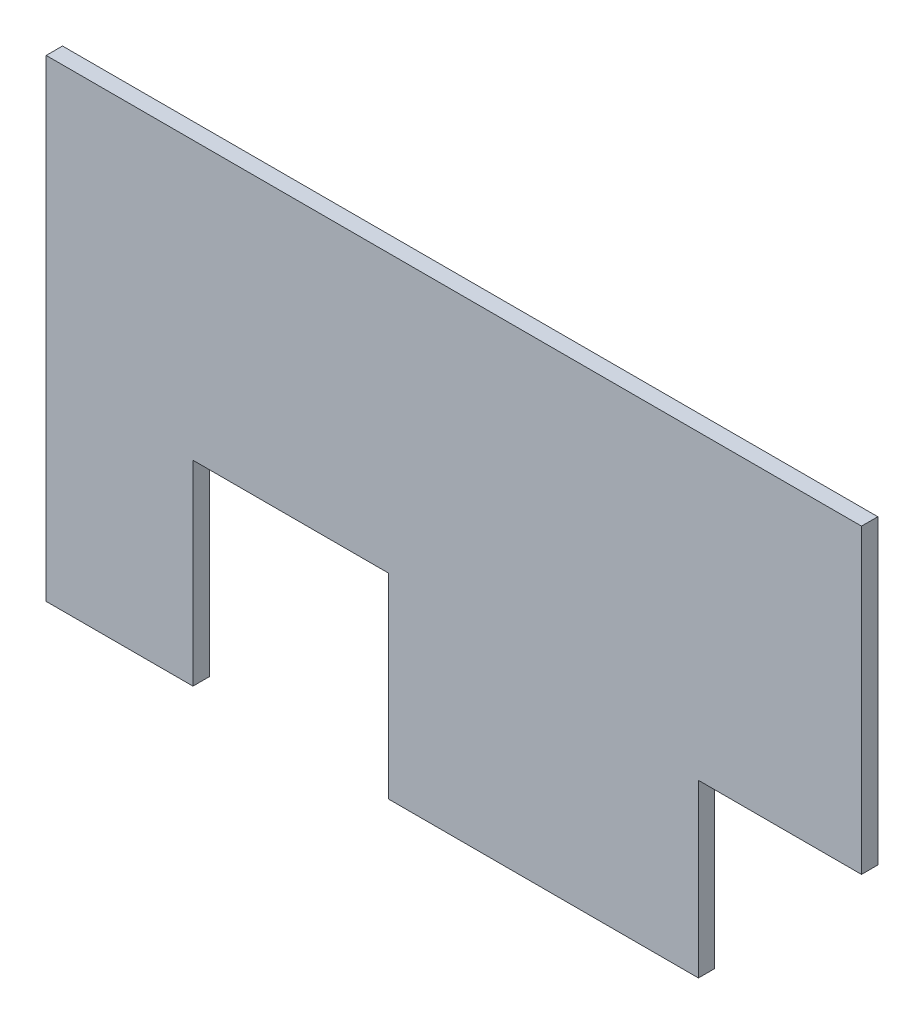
from build123d import *

# Parameters (mm, degrees)
ESQUISSE1_W             = 50
ESQUISSE1_H             = 29
BOSS_EXTRU_1_DEPTH      = 1
ESQUISSE2_W             = 12
ESQUISSE2_H             = 12
ENL_V_MAT_EXTRU_1_DEPTH = 1.5
ESQUISSE3_W             = 10
ESQUISSE3_H             = 10.5
ENL_V_MAT_EXTRU_2_DEPTH = 1.5


with BuildPart() as part:
    # Esquisse1 → Boss.-Extru.1 (new body)
    with BuildSketch(Plane.XY):
        with Locations((25, 14.5)):
            Rectangle(ESQUISSE1_W, ESQUISSE1_H)
    extrude(amount=BOSS_EXTRU_1_DEPTH)

    # Esquisse2 → Enl_v. mat.-Extru.1 (cut)
    with BuildSketch(Plane.XY.offset(1)):
        with Locations((15, 6)):
            Rectangle(ESQUISSE2_W, ESQUISSE2_H)
    extrude(amount=-ENL_V_MAT_EXTRU_1_DEPTH, mode=Mode.SUBTRACT)

    # Esquisse3 → Enl_v. mat.-Extru.2 (cut)
    with BuildSketch(Plane.XY.offset(1)):
        with Locations((45, 5.25)):
            Rectangle(ESQUISSE3_W, ESQUISSE3_H)
    extrude(amount=-ENL_V_MAT_EXTRU_2_DEPTH, mode=Mode.SUBTRACT)


solid = part.part
